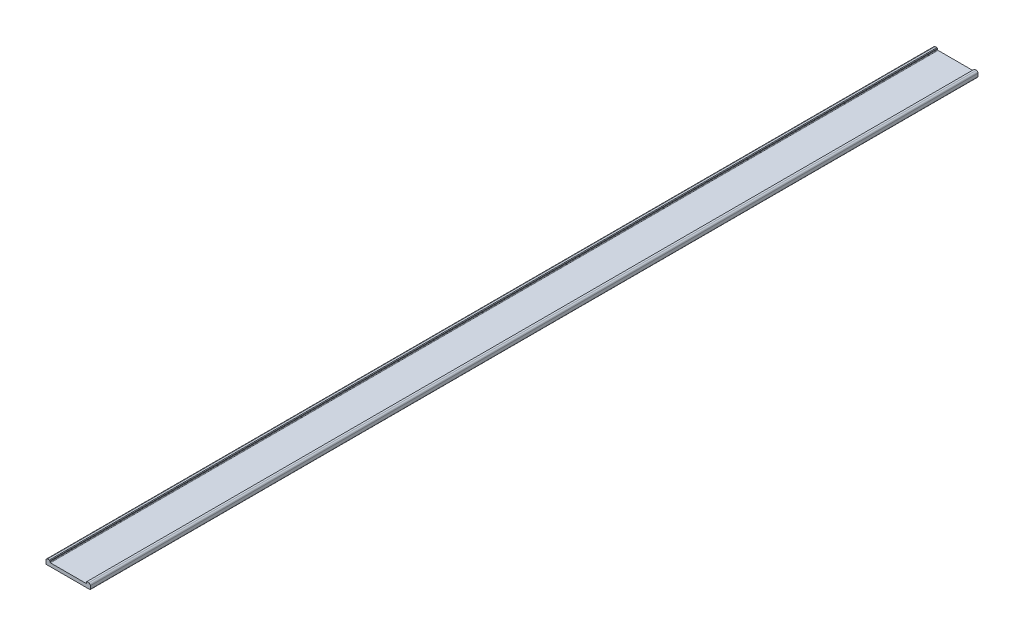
ISO-10303-21;
HEADER;
FILE_DESCRIPTION(('STEP AP214'),'2;1');
FILE_NAME('part.step','',(''),(''),'','','');
FILE_SCHEMA(('AUTOMOTIVE_DESIGN { 1 0 10303 214 1 1 1 1 }'));
ENDSEC;
DATA;
#1=APPLICATION_CONTEXT('core data for automotive mechanical design processes');
#2=APPLICATION_PROTOCOL_DEFINITION('international standard','automotive_design',2000,#1);
#3=PRODUCT_CONTEXT('',#1,'mechanical');
#4=PRODUCT('Part','Part','',(#3));
#5=PRODUCT_RELATED_PRODUCT_CATEGORY('part','',(#4));
#6=PRODUCT_DEFINITION_FORMATION('','',#4);
#7=PRODUCT_DEFINITION_CONTEXT('part definition',#1,'design');
#8=PRODUCT_DEFINITION('design','',#6,#7);
#9=PRODUCT_DEFINITION_SHAPE('','',#8);
#10=(LENGTH_UNIT() NAMED_UNIT(*) SI_UNIT(.MILLI.,.METRE.));
#11=(NAMED_UNIT(*) PLANE_ANGLE_UNIT() SI_UNIT($,.RADIAN.));
#12=(NAMED_UNIT(*) SI_UNIT($,.STERADIAN.) SOLID_ANGLE_UNIT());
#13=UNCERTAINTY_MEASURE_WITH_UNIT(LENGTH_MEASURE(1.E-05),#10,'distance_accuracy_value','');
#14=(GEOMETRIC_REPRESENTATION_CONTEXT(3) GLOBAL_UNCERTAINTY_ASSIGNED_CONTEXT((#13)) GLOBAL_UNIT_ASSIGNED_CONTEXT((#10,
#11,#12)) REPRESENTATION_CONTEXT('',''));
#15=CARTESIAN_POINT('',(0.,0.,0.));
#16=DIRECTION('',(0.,0.,1.));
#17=DIRECTION('',(1.,0.,0.));
#18=AXIS2_PLACEMENT_3D('',#15,#16,#17);
#19=CARTESIAN_POINT('',(39.5,0.5,-800.));
#20=DIRECTION('',(0.,0.,1.));
#21=DIRECTION('',(1.,0.,0.));
#22=AXIS2_PLACEMENT_3D('',#19,#20,#21);
#23=CYLINDRICAL_SURFACE('',#22,0.5);
#24=CARTESIAN_POINT('',(39.5,0.5,0.));
#25=DIRECTION('',(0.,0.,1.));
#26=DIRECTION('',(1.,0.,0.));
#27=AXIS2_PLACEMENT_3D('',#24,#25,#26);
#28=CIRCLE('',#27,0.5);
#29=CARTESIAN_POINT('',(39.5,0.,0.));
#30=VERTEX_POINT('',#29);
#31=CARTESIAN_POINT('',(40.,0.500000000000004,0.));
#32=VERTEX_POINT('',#31);
#33=EDGE_CURVE('E186',#30,#32,#28,.T.);
#34=ORIENTED_EDGE('',*,*,#33,.F.);
#35=DIRECTION('',(0.,0.,1.));
#36=VECTOR('',#35,1.);
#37=CARTESIAN_POINT('',(39.5,0.,-800.));
#38=LINE('',#37,#36);
#39=CARTESIAN_POINT('',(39.5,0.,-800.));
#40=VERTEX_POINT('',#39);
#41=EDGE_CURVE('E11',#40,#30,#38,.T.);
#42=ORIENTED_EDGE('',*,*,#41,.F.);
#43=CARTESIAN_POINT('',(39.5,0.5,-800.));
#44=DIRECTION('',(0.,0.,1.));
#45=DIRECTION('',(1.,0.,0.));
#46=AXIS2_PLACEMENT_3D('',#43,#44,#45);
#47=CIRCLE('',#46,0.5);
#48=CARTESIAN_POINT('',(40.,0.500000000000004,-800.));
#49=VERTEX_POINT('',#48);
#50=EDGE_CURVE('E230',#40,#49,#47,.T.);
#51=ORIENTED_EDGE('',*,*,#50,.T.);
#52=DIRECTION('',(0.,0.,1.));
#53=VECTOR('',#52,1.);
#54=CARTESIAN_POINT('',(40.,0.500000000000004,-800.));
#55=LINE('',#54,#53);
#56=EDGE_CURVE('E44',#49,#32,#55,.T.);
#57=ORIENTED_EDGE('',*,*,#56,.T.);
#58=EDGE_LOOP('',(#34,#42,#51,#57));
#59=FACE_BOUND('',#58,.T.);
#60=ADVANCED_FACE('F41',(#59),#23,.T.);
#61=CARTESIAN_POINT('',(0.500000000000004,0.,-800.));
#62=DIRECTION('',(0.,-1.,0.));
#63=DIRECTION('',(0.,0.,-1.));
#64=AXIS2_PLACEMENT_3D('',#61,#62,#63);
#65=PLANE('',#64);
#66=DIRECTION('',(1.,0.,0.));
#67=VECTOR('',#66,1.);
#68=CARTESIAN_POINT('',(0.500000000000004,0.,0.));
#69=LINE('',#68,#67);
#70=CARTESIAN_POINT('',(0.500000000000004,0.,0.));
#71=VERTEX_POINT('',#70);
#72=EDGE_CURVE('E228',#71,#30,#69,.T.);
#73=ORIENTED_EDGE('',*,*,#72,.F.);
#74=DIRECTION('',(0.,0.,1.));
#75=VECTOR('',#74,1.);
#76=CARTESIAN_POINT('',(0.500000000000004,0.,-800.));
#77=LINE('',#76,#75);
#78=CARTESIAN_POINT('',(0.500000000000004,0.,-800.));
#79=VERTEX_POINT('',#78);
#80=EDGE_CURVE('E50',#79,#71,#77,.T.);
#81=ORIENTED_EDGE('',*,*,#80,.F.);
#82=DIRECTION('',(1.,0.,0.));
#83=VECTOR('',#82,1.);
#84=CARTESIAN_POINT('',(0.500000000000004,0.,-800.));
#85=LINE('',#84,#83);
#86=EDGE_CURVE('E176',#79,#40,#85,.T.);
#87=ORIENTED_EDGE('',*,*,#86,.T.);
#88=ORIENTED_EDGE('',*,*,#41,.T.);
#89=EDGE_LOOP('',(#73,#81,#87,#88));
#90=FACE_BOUND('',#89,.T.);
#91=ADVANCED_FACE('F258',(#90),#65,.T.);
#92=CARTESIAN_POINT('',(0.5,0.5,-800.));
#93=DIRECTION('',(0.,0.,1.));
#94=DIRECTION('',(1.,0.,0.));
#95=AXIS2_PLACEMENT_3D('',#92,#93,#94);
#96=CYLINDRICAL_SURFACE('',#95,0.5);
#97=CARTESIAN_POINT('',(0.5,0.5,0.));
#98=DIRECTION('',(0.,0.,1.));
#99=DIRECTION('',(1.,0.,0.));
#100=AXIS2_PLACEMENT_3D('',#97,#98,#99);
#101=CIRCLE('',#100,0.5);
#102=CARTESIAN_POINT('',(0.,0.500000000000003,0.));
#103=VERTEX_POINT('',#102);
#104=EDGE_CURVE('E163',#103,#71,#101,.T.);
#105=ORIENTED_EDGE('',*,*,#104,.F.);
#106=DIRECTION('',(0.,0.,1.));
#107=VECTOR('',#106,1.);
#108=CARTESIAN_POINT('',(0.,0.500000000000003,-800.));
#109=LINE('',#108,#107);
#110=CARTESIAN_POINT('',(0.,0.500000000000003,-800.));
#111=VERTEX_POINT('',#110);
#112=EDGE_CURVE('E158',#111,#103,#109,.T.);
#113=ORIENTED_EDGE('',*,*,#112,.F.);
#114=CARTESIAN_POINT('',(0.5,0.5,-800.));
#115=DIRECTION('',(0.,0.,1.));
#116=DIRECTION('',(1.,0.,0.));
#117=AXIS2_PLACEMENT_3D('',#114,#115,#116);
#118=CIRCLE('',#117,0.5);
#119=EDGE_CURVE('E161',#111,#79,#118,.T.);
#120=ORIENTED_EDGE('',*,*,#119,.T.);
#121=ORIENTED_EDGE('',*,*,#80,.T.);
#122=EDGE_LOOP('',(#105,#113,#120,#121));
#123=FACE_BOUND('',#122,.T.);
#124=ADVANCED_FACE('F160',(#123),#96,.T.);
#125=CARTESIAN_POINT('',(0.,0.500000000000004,-800.));
#126=DIRECTION('',(-1.,0.,0.));
#127=DIRECTION('',(0.,0.,1.));
#128=AXIS2_PLACEMENT_3D('',#125,#126,#127);
#129=PLANE('',#128);
#130=DIRECTION('',(0.,-1.,0.));
#131=VECTOR('',#130,1.);
#132=CARTESIAN_POINT('',(0.,0.500000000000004,0.));
#133=LINE('',#132,#131);
#134=CARTESIAN_POINT('',(0.,3.3,0.));
#135=VERTEX_POINT('',#134);
#136=EDGE_CURVE('E225',#135,#103,#133,.T.);
#137=ORIENTED_EDGE('',*,*,#136,.F.);
#138=DIRECTION('',(0.,0.,1.));
#139=VECTOR('',#138,1.);
#140=CARTESIAN_POINT('',(0.,3.3,-800.));
#141=LINE('',#140,#139);
#142=CARTESIAN_POINT('',(0.,3.3,-800.));
#143=VERTEX_POINT('',#142);
#144=EDGE_CURVE('E168',#143,#135,#141,.T.);
#145=ORIENTED_EDGE('',*,*,#144,.F.);
#146=DIRECTION('',(0.,-1.,0.));
#147=VECTOR('',#146,1.);
#148=CARTESIAN_POINT('',(0.,0.500000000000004,-800.));
#149=LINE('',#148,#147);
#150=EDGE_CURVE('E174',#143,#111,#149,.T.);
#151=ORIENTED_EDGE('',*,*,#150,.T.);
#152=ORIENTED_EDGE('',*,*,#112,.T.);
#153=EDGE_LOOP('',(#137,#145,#151,#152));
#154=FACE_BOUND('',#153,.T.);
#155=ADVANCED_FACE('F178',(#154),#129,.T.);
#156=CARTESIAN_POINT('',(1.5,3.3,-800.));
#157=DIRECTION('',(0.,0.,1.));
#158=DIRECTION('',(1.,0.,0.));
#159=AXIS2_PLACEMENT_3D('',#156,#157,#158);
#160=CYLINDRICAL_SURFACE('',#159,1.5);
#161=CARTESIAN_POINT('',(1.5,3.3,0.));
#162=DIRECTION('',(0.,0.,1.));
#163=DIRECTION('',(-1.,0.,0.));
#164=AXIS2_PLACEMENT_3D('',#161,#162,#163);
#165=CIRCLE('',#164,1.5);
#166=CARTESIAN_POINT('',(1.5,4.8,0.));
#167=VERTEX_POINT('',#166);
#168=EDGE_CURVE('E222',#167,#135,#165,.T.);
#169=ORIENTED_EDGE('',*,*,#168,.F.);
#170=DIRECTION('',(0.,0.,1.));
#171=VECTOR('',#170,1.);
#172=CARTESIAN_POINT('',(1.5,4.8,-800.));
#173=LINE('',#172,#171);
#174=CARTESIAN_POINT('',(1.5,4.8,-800.));
#175=VERTEX_POINT('',#174);
#176=EDGE_CURVE('E234',#175,#167,#173,.T.);
#177=ORIENTED_EDGE('',*,*,#176,.F.);
#178=CARTESIAN_POINT('',(1.5,3.3,-800.));
#179=DIRECTION('',(0.,0.,1.));
#180=DIRECTION('',(-1.,0.,0.));
#181=AXIS2_PLACEMENT_3D('',#178,#179,#180);
#182=CIRCLE('',#181,1.5);
#183=EDGE_CURVE('E179',#175,#143,#182,.T.);
#184=ORIENTED_EDGE('',*,*,#183,.T.);
#185=ORIENTED_EDGE('',*,*,#144,.T.);
#186=EDGE_LOOP('',(#169,#177,#184,#185));
#187=FACE_BOUND('',#186,.T.);
#188=ADVANCED_FACE('F271',(#187),#160,.T.);
#189=CARTESIAN_POINT('',(1.5,4.8,-800.));
#190=DIRECTION('',(0.,1.,0.));
#191=DIRECTION('',(-1.,0.,0.));
#192=AXIS2_PLACEMENT_3D('',#189,#190,#191);
#193=PLANE('',#192);
#194=DIRECTION('',(-1.,0.,0.));
#195=VECTOR('',#194,1.);
#196=CARTESIAN_POINT('',(1.5,4.8,0.));
#197=LINE('',#196,#195);
#198=CARTESIAN_POINT('',(3.,4.8,0.));
#199=VERTEX_POINT('',#198);
#200=EDGE_CURVE('E219',#199,#167,#197,.T.);
#201=ORIENTED_EDGE('',*,*,#200,.F.);
#202=DIRECTION('',(0.,0.,1.));
#203=VECTOR('',#202,1.);
#204=CARTESIAN_POINT('',(3.,4.8,-800.));
#205=LINE('',#204,#203);
#206=CARTESIAN_POINT('',(3.,4.8,-800.));
#207=VERTEX_POINT('',#206);
#208=EDGE_CURVE('E236',#207,#199,#205,.T.);
#209=ORIENTED_EDGE('',*,*,#208,.F.);
#210=DIRECTION('',(-1.,0.,0.));
#211=VECTOR('',#210,1.);
#212=CARTESIAN_POINT('',(1.5,4.8,-800.));
#213=LINE('',#212,#211);
#214=EDGE_CURVE('E181',#207,#175,#213,.T.);
#215=ORIENTED_EDGE('',*,*,#214,.T.);
#216=ORIENTED_EDGE('',*,*,#176,.T.);
#217=EDGE_LOOP('',(#201,#209,#215,#216));
#218=FACE_BOUND('',#217,.T.);
#219=ADVANCED_FACE('F274',(#218),#193,.T.);
#220=CARTESIAN_POINT('',(3.,4.8,-800.));
#221=DIRECTION('',(0.707106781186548,0.707106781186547,0.));
#222=DIRECTION('',(-0.707106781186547,0.707106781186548,0.));
#223=AXIS2_PLACEMENT_3D('',#220,#221,#222);
#224=PLANE('',#223);
#225=DIRECTION('',(-0.707106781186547,0.707106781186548,0.));
#226=VECTOR('',#225,1.);
#227=CARTESIAN_POINT('',(3.,4.8,0.));
#228=LINE('',#227,#226);
#229=CARTESIAN_POINT('',(3.5,4.3,0.));
#230=VERTEX_POINT('',#229);
#231=EDGE_CURVE('E216',#230,#199,#228,.T.);
#232=ORIENTED_EDGE('',*,*,#231,.F.);
#233=DIRECTION('',(0.,0.,1.));
#234=VECTOR('',#233,1.);
#235=CARTESIAN_POINT('',(3.5,4.3,-800.));
#236=LINE('',#235,#234);
#237=CARTESIAN_POINT('',(3.5,4.3,-800.));
#238=VERTEX_POINT('',#237);
#239=EDGE_CURVE('E238',#238,#230,#236,.T.);
#240=ORIENTED_EDGE('',*,*,#239,.F.);
#241=DIRECTION('',(-0.707106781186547,0.707106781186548,0.));
#242=VECTOR('',#241,1.);
#243=CARTESIAN_POINT('',(3.,4.8,-800.));
#244=LINE('',#243,#242);
#245=EDGE_CURVE('E455',#238,#207,#244,.T.);
#246=ORIENTED_EDGE('',*,*,#245,.T.);
#247=ORIENTED_EDGE('',*,*,#208,.T.);
#248=EDGE_LOOP('',(#232,#240,#246,#247));
#249=FACE_BOUND('',#248,.T.);
#250=ADVANCED_FACE('F278',(#249),#224,.T.);
#251=CARTESIAN_POINT('',(3.5,4.3,-800.));
#252=DIRECTION('',(1.,0.,0.));
#253=DIRECTION('',(0.,1.,0.));
#254=AXIS2_PLACEMENT_3D('',#251,#252,#253);
#255=PLANE('',#254);
#256=DIRECTION('',(0.,1.,0.));
#257=VECTOR('',#256,1.);
#258=CARTESIAN_POINT('',(3.5,4.3,0.));
#259=LINE('',#258,#257);
#260=CARTESIAN_POINT('',(3.5,3.6,0.));
#261=VERTEX_POINT('',#260);
#262=EDGE_CURVE('E213',#261,#230,#259,.T.);
#263=ORIENTED_EDGE('',*,*,#262,.F.);
#264=DIRECTION('',(0.,0.,1.));
#265=VECTOR('',#264,1.);
#266=CARTESIAN_POINT('',(3.5,3.6,-800.));
#267=LINE('',#266,#265);
#268=CARTESIAN_POINT('',(3.5,3.6,-800.));
#269=VERTEX_POINT('',#268);
#270=EDGE_CURVE('E240',#269,#261,#267,.T.);
#271=ORIENTED_EDGE('',*,*,#270,.F.);
#272=DIRECTION('',(0.,1.,0.));
#273=VECTOR('',#272,1.);
#274=CARTESIAN_POINT('',(3.5,4.3,-800.));
#275=LINE('',#274,#273);
#276=EDGE_CURVE('E451',#269,#238,#275,.T.);
#277=ORIENTED_EDGE('',*,*,#276,.T.);
#278=ORIENTED_EDGE('',*,*,#239,.T.);
#279=EDGE_LOOP('',(#263,#271,#277,#278));
#280=FACE_BOUND('',#279,.T.);
#281=ADVANCED_FACE('F282',(#280),#255,.T.);
#282=CARTESIAN_POINT('',(4.,3.6,-800.));
#283=DIRECTION('',(0.,0.,1.));
#284=DIRECTION('',(1.,0.,0.));
#285=AXIS2_PLACEMENT_3D('',#282,#283,#284);
#286=CYLINDRICAL_SURFACE('',#285,0.5);
#287=CARTESIAN_POINT('',(4.,3.6,0.));
#288=DIRECTION('',(0.,0.,-1.));
#289=DIRECTION('',(1.,0.,0.));
#290=AXIS2_PLACEMENT_3D('',#287,#288,#289);
#291=CIRCLE('',#290,0.5);
#292=CARTESIAN_POINT('',(4.,3.1,0.));
#293=VERTEX_POINT('',#292);
#294=EDGE_CURVE('E210',#293,#261,#291,.T.);
#295=ORIENTED_EDGE('',*,*,#294,.F.);
#296=DIRECTION('',(0.,0.,1.));
#297=VECTOR('',#296,1.);
#298=CARTESIAN_POINT('',(4.,3.1,-800.));
#299=LINE('',#298,#297);
#300=CARTESIAN_POINT('',(4.,3.1,-800.));
#301=VERTEX_POINT('',#300);
#302=EDGE_CURVE('E242',#301,#293,#299,.T.);
#303=ORIENTED_EDGE('',*,*,#302,.F.);
#304=CARTESIAN_POINT('',(4.,3.6,-800.));
#305=DIRECTION('',(0.,0.,-1.));
#306=DIRECTION('',(1.,0.,0.));
#307=AXIS2_PLACEMENT_3D('',#304,#305,#306);
#308=CIRCLE('',#307,0.5);
#309=EDGE_CURVE('E462',#301,#269,#308,.T.);
#310=ORIENTED_EDGE('',*,*,#309,.T.);
#311=ORIENTED_EDGE('',*,*,#270,.T.);
#312=EDGE_LOOP('',(#295,#303,#310,#311));
#313=FACE_BOUND('',#312,.T.);
#314=ADVANCED_FACE('F286',(#313),#286,.F.);
#315=CARTESIAN_POINT('',(4.,3.1,-800.));
#316=DIRECTION('',(0.,1.,0.));
#317=DIRECTION('',(0.,0.,1.));
#318=AXIS2_PLACEMENT_3D('',#315,#316,#317);
#319=PLANE('',#318);
#320=DIRECTION('',(-1.,0.,0.));
#321=VECTOR('',#320,1.);
#322=CARTESIAN_POINT('',(4.,3.1,0.));
#323=LINE('',#322,#321);
#324=CARTESIAN_POINT('',(36.,3.1,0.));
#325=VERTEX_POINT('',#324);
#326=EDGE_CURVE('E207',#325,#293,#323,.T.);
#327=ORIENTED_EDGE('',*,*,#326,.F.);
#328=DIRECTION('',(0.,0.,1.));
#329=VECTOR('',#328,1.);
#330=CARTESIAN_POINT('',(36.,3.1,-800.));
#331=LINE('',#330,#329);
#332=CARTESIAN_POINT('',(36.,3.1,-800.));
#333=VERTEX_POINT('',#332);
#334=EDGE_CURVE('E244',#333,#325,#331,.T.);
#335=ORIENTED_EDGE('',*,*,#334,.F.);
#336=DIRECTION('',(-1.,0.,0.));
#337=VECTOR('',#336,1.);
#338=CARTESIAN_POINT('',(4.,3.1,-800.));
#339=LINE('',#338,#337);
#340=EDGE_CURVE('E444',#333,#301,#339,.T.);
#341=ORIENTED_EDGE('',*,*,#340,.T.);
#342=ORIENTED_EDGE('',*,*,#302,.T.);
#343=EDGE_LOOP('',(#327,#335,#341,#342));
#344=FACE_BOUND('',#343,.T.);
#345=ADVANCED_FACE('F290',(#344),#319,.T.);
#346=CARTESIAN_POINT('',(36.,3.6,-800.));
#347=DIRECTION('',(0.,0.,1.));
#348=DIRECTION('',(1.,0.,0.));
#349=AXIS2_PLACEMENT_3D('',#346,#347,#348);
#350=CYLINDRICAL_SURFACE('',#349,0.5);
#351=CARTESIAN_POINT('',(36.,3.6,0.));
#352=DIRECTION('',(0.,0.,-1.));
#353=DIRECTION('',(-1.,0.,0.));
#354=AXIS2_PLACEMENT_3D('',#351,#352,#353);
#355=CIRCLE('',#354,0.5);
#356=CARTESIAN_POINT('',(36.5,3.6,0.));
#357=VERTEX_POINT('',#356);
#358=EDGE_CURVE('E204',#357,#325,#355,.T.);
#359=ORIENTED_EDGE('',*,*,#358,.F.);
#360=DIRECTION('',(0.,0.,1.));
#361=VECTOR('',#360,1.);
#362=CARTESIAN_POINT('',(36.5,3.6,-800.));
#363=LINE('',#362,#361);
#364=CARTESIAN_POINT('',(36.5,3.6,-800.));
#365=VERTEX_POINT('',#364);
#366=EDGE_CURVE('E246',#365,#357,#363,.T.);
#367=ORIENTED_EDGE('',*,*,#366,.F.);
#368=CARTESIAN_POINT('',(36.,3.6,-800.));
#369=DIRECTION('',(0.,0.,-1.));
#370=DIRECTION('',(-1.,0.,0.));
#371=AXIS2_PLACEMENT_3D('',#368,#369,#370);
#372=CIRCLE('',#371,0.5);
#373=EDGE_CURVE('E440',#365,#333,#372,.T.);
#374=ORIENTED_EDGE('',*,*,#373,.T.);
#375=ORIENTED_EDGE('',*,*,#334,.T.);
#376=EDGE_LOOP('',(#359,#367,#374,#375));
#377=FACE_BOUND('',#376,.T.);
#378=ADVANCED_FACE('F294',(#377),#350,.F.);
#379=CARTESIAN_POINT('',(36.5,4.55,-800.));
#380=DIRECTION('',(-1.,0.,0.));
#381=DIRECTION('',(0.,0.,1.));
#382=AXIS2_PLACEMENT_3D('',#379,#380,#381);
#383=PLANE('',#382);
#384=DIRECTION('',(0.,-1.,0.));
#385=VECTOR('',#384,1.);
#386=CARTESIAN_POINT('',(36.5,4.55,0.));
#387=LINE('',#386,#385);
#388=CARTESIAN_POINT('',(36.5,4.55,0.));
#389=VERTEX_POINT('',#388);
#390=EDGE_CURVE('E201',#389,#357,#387,.T.);
#391=ORIENTED_EDGE('',*,*,#390,.F.);
#392=DIRECTION('',(0.,0.,1.));
#393=VECTOR('',#392,1.);
#394=CARTESIAN_POINT('',(36.5,4.55,-800.));
#395=LINE('',#394,#393);
#396=CARTESIAN_POINT('',(36.5,4.55,-800.));
#397=VERTEX_POINT('',#396);
#398=EDGE_CURVE('E248',#397,#389,#395,.T.);
#399=ORIENTED_EDGE('',*,*,#398,.F.);
#400=DIRECTION('',(0.,-1.,0.));
#401=VECTOR('',#400,1.);
#402=CARTESIAN_POINT('',(36.5,4.55,-800.));
#403=LINE('',#402,#401);
#404=EDGE_CURVE('E466',#397,#365,#403,.T.);
#405=ORIENTED_EDGE('',*,*,#404,.T.);
#406=ORIENTED_EDGE('',*,*,#366,.T.);
#407=EDGE_LOOP('',(#391,#399,#405,#406));
#408=FACE_BOUND('',#407,.T.);
#409=ADVANCED_FACE('F298',(#408),#383,.T.);
#410=CARTESIAN_POINT('',(36.75,4.8,-800.));
#411=DIRECTION('',(-0.707106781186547,0.707106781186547,0.));
#412=DIRECTION('',(-0.707106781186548,-0.707106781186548,0.));
#413=AXIS2_PLACEMENT_3D('',#410,#411,#412);
#414=PLANE('',#413);
#415=DIRECTION('',(-0.707106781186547,-0.707106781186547,0.));
#416=VECTOR('',#415,1.);
#417=CARTESIAN_POINT('',(36.75,4.8,0.));
#418=LINE('',#417,#416);
#419=CARTESIAN_POINT('',(36.75,4.8,0.));
#420=VERTEX_POINT('',#419);
#421=EDGE_CURVE('E198',#420,#389,#418,.T.);
#422=ORIENTED_EDGE('',*,*,#421,.F.);
#423=DIRECTION('',(0.,0.,1.));
#424=VECTOR('',#423,1.);
#425=CARTESIAN_POINT('',(36.75,4.8,-800.));
#426=LINE('',#425,#424);
#427=CARTESIAN_POINT('',(36.75,4.8,-800.));
#428=VERTEX_POINT('',#427);
#429=EDGE_CURVE('E250',#428,#420,#426,.T.);
#430=ORIENTED_EDGE('',*,*,#429,.F.);
#431=DIRECTION('',(-0.707106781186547,-0.707106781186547,0.));
#432=VECTOR('',#431,1.);
#433=CARTESIAN_POINT('',(36.75,4.8,-800.));
#434=LINE('',#433,#432);
#435=EDGE_CURVE('E433',#428,#397,#434,.T.);
#436=ORIENTED_EDGE('',*,*,#435,.T.);
#437=ORIENTED_EDGE('',*,*,#398,.T.);
#438=EDGE_LOOP('',(#422,#430,#436,#437));
#439=FACE_BOUND('',#438,.T.);
#440=ADVANCED_FACE('F302',(#439),#414,.T.);
#441=CARTESIAN_POINT('',(36.75,4.8,-800.));
#442=DIRECTION('',(0.,1.,0.));
#443=DIRECTION('',(0.,0.,1.));
#444=AXIS2_PLACEMENT_3D('',#441,#442,#443);
#445=PLANE('',#444);
#446=DIRECTION('',(-1.,0.,0.));
#447=VECTOR('',#446,1.);
#448=CARTESIAN_POINT('',(36.75,4.8,0.));
#449=LINE('',#448,#447);
#450=CARTESIAN_POINT('',(38.5,4.8,0.));
#451=VERTEX_POINT('',#450);
#452=EDGE_CURVE('E195',#451,#420,#449,.T.);
#453=ORIENTED_EDGE('',*,*,#452,.F.);
#454=DIRECTION('',(0.,0.,1.));
#455=VECTOR('',#454,1.);
#456=CARTESIAN_POINT('',(38.5,4.8,-800.));
#457=LINE('',#456,#455);
#458=CARTESIAN_POINT('',(38.5,4.8,-800.));
#459=VERTEX_POINT('',#458);
#460=EDGE_CURVE('E252',#459,#451,#457,.T.);
#461=ORIENTED_EDGE('',*,*,#460,.F.);
#462=DIRECTION('',(-1.,0.,0.));
#463=VECTOR('',#462,1.);
#464=CARTESIAN_POINT('',(36.75,4.8,-800.));
#465=LINE('',#464,#463);
#466=EDGE_CURVE('E429',#459,#428,#465,.T.);
#467=ORIENTED_EDGE('',*,*,#466,.T.);
#468=ORIENTED_EDGE('',*,*,#429,.T.);
#469=EDGE_LOOP('',(#453,#461,#467,#468));
#470=FACE_BOUND('',#469,.T.);
#471=ADVANCED_FACE('F306',(#470),#445,.T.);
#472=CARTESIAN_POINT('',(38.5,3.3,-800.));
#473=DIRECTION('',(0.,0.,1.));
#474=DIRECTION('',(1.,0.,0.));
#475=AXIS2_PLACEMENT_3D('',#472,#473,#474);
#476=CYLINDRICAL_SURFACE('',#475,1.5);
#477=CARTESIAN_POINT('',(38.5,3.3,0.));
#478=DIRECTION('',(0.,0.,1.));
#479=DIRECTION('',(-1.,0.,0.));
#480=AXIS2_PLACEMENT_3D('',#477,#478,#479);
#481=CIRCLE('',#480,1.5);
#482=CARTESIAN_POINT('',(40.,3.3,0.));
#483=VERTEX_POINT('',#482);
#484=EDGE_CURVE('E192',#483,#451,#481,.T.);
#485=ORIENTED_EDGE('',*,*,#484,.F.);
#486=DIRECTION('',(0.,0.,1.));
#487=VECTOR('',#486,1.);
#488=CARTESIAN_POINT('',(40.,3.3,-800.));
#489=LINE('',#488,#487);
#490=CARTESIAN_POINT('',(40.,3.3,-800.));
#491=VERTEX_POINT('',#490);
#492=EDGE_CURVE('E253',#491,#483,#489,.T.);
#493=ORIENTED_EDGE('',*,*,#492,.F.);
#494=CARTESIAN_POINT('',(38.5,3.3,-800.));
#495=DIRECTION('',(0.,0.,1.));
#496=DIRECTION('',(-1.,0.,0.));
#497=AXIS2_PLACEMENT_3D('',#494,#495,#496);
#498=CIRCLE('',#497,1.5);
#499=EDGE_CURVE('E470',#491,#459,#498,.T.);
#500=ORIENTED_EDGE('',*,*,#499,.T.);
#501=ORIENTED_EDGE('',*,*,#460,.T.);
#502=EDGE_LOOP('',(#485,#493,#500,#501));
#503=FACE_BOUND('',#502,.T.);
#504=ADVANCED_FACE('F310',(#503),#476,.T.);
#505=CARTESIAN_POINT('',(40.,0.500000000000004,-800.));
#506=DIRECTION('',(1.,0.,0.));
#507=DIRECTION('',(0.,0.,-1.));
#508=AXIS2_PLACEMENT_3D('',#505,#506,#507);
#509=PLANE('',#508);
#510=DIRECTION('',(0.,1.,0.));
#511=VECTOR('',#510,1.);
#512=CARTESIAN_POINT('',(40.,0.500000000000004,0.));
#513=LINE('',#512,#511);
#514=EDGE_CURVE('E189',#32,#483,#513,.T.);
#515=ORIENTED_EDGE('',*,*,#514,.F.);
#516=ORIENTED_EDGE('',*,*,#56,.F.);
#517=DIRECTION('',(0.,1.,0.));
#518=VECTOR('',#517,1.);
#519=CARTESIAN_POINT('',(40.,0.500000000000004,-800.));
#520=LINE('',#519,#518);
#521=EDGE_CURVE('E472',#49,#491,#520,.T.);
#522=ORIENTED_EDGE('',*,*,#521,.T.);
#523=ORIENTED_EDGE('',*,*,#492,.T.);
#524=EDGE_LOOP('',(#515,#516,#522,#523));
#525=FACE_BOUND('',#524,.T.);
#526=ADVANCED_FACE('F255',(#525),#509,.T.);
#527=CARTESIAN_POINT('',(39.5,0.5,-800.));
#528=DIRECTION('',(0.,0.,1.));
#529=DIRECTION('',(1.,0.,0.));
#530=AXIS2_PLACEMENT_3D('',#527,#528,#529);
#531=PLANE('',#530);
#532=ORIENTED_EDGE('',*,*,#50,.F.);
#533=ORIENTED_EDGE('',*,*,#86,.F.);
#534=ORIENTED_EDGE('',*,*,#119,.F.);
#535=ORIENTED_EDGE('',*,*,#150,.F.);
#536=ORIENTED_EDGE('',*,*,#183,.F.);
#537=ORIENTED_EDGE('',*,*,#214,.F.);
#538=ORIENTED_EDGE('',*,*,#245,.F.);
#539=ORIENTED_EDGE('',*,*,#276,.F.);
#540=ORIENTED_EDGE('',*,*,#309,.F.);
#541=ORIENTED_EDGE('',*,*,#340,.F.);
#542=ORIENTED_EDGE('',*,*,#373,.F.);
#543=ORIENTED_EDGE('',*,*,#404,.F.);
#544=ORIENTED_EDGE('',*,*,#435,.F.);
#545=ORIENTED_EDGE('',*,*,#466,.F.);
#546=ORIENTED_EDGE('',*,*,#499,.F.);
#547=ORIENTED_EDGE('',*,*,#521,.F.);
#548=EDGE_LOOP('',(#532,#533,#534,#535,#536,#537,#538,#539,#540,#541,#542,#543,#544,#545,#546,#547));
#549=FACE_BOUND('',#548,.T.);
#550=ADVANCED_FACE('F172',(#549),#531,.F.);
#551=CARTESIAN_POINT('',(39.5,0.5,0.));
#552=DIRECTION('',(0.,0.,1.));
#553=DIRECTION('',(1.,0.,0.));
#554=AXIS2_PLACEMENT_3D('',#551,#552,#553);
#555=PLANE('',#554);
#556=ORIENTED_EDGE('',*,*,#33,.T.);
#557=ORIENTED_EDGE('',*,*,#514,.T.);
#558=ORIENTED_EDGE('',*,*,#484,.T.);
#559=ORIENTED_EDGE('',*,*,#452,.T.);
#560=ORIENTED_EDGE('',*,*,#421,.T.);
#561=ORIENTED_EDGE('',*,*,#390,.T.);
#562=ORIENTED_EDGE('',*,*,#358,.T.);
#563=ORIENTED_EDGE('',*,*,#326,.T.);
#564=ORIENTED_EDGE('',*,*,#294,.T.);
#565=ORIENTED_EDGE('',*,*,#262,.T.);
#566=ORIENTED_EDGE('',*,*,#231,.T.);
#567=ORIENTED_EDGE('',*,*,#200,.T.);
#568=ORIENTED_EDGE('',*,*,#168,.T.);
#569=ORIENTED_EDGE('',*,*,#136,.T.);
#570=ORIENTED_EDGE('',*,*,#104,.T.);
#571=ORIENTED_EDGE('',*,*,#72,.T.);
#572=EDGE_LOOP('',(#556,#557,#558,#559,#560,#561,#562,#563,#564,#565,#566,#567,#568,#569,#570,#571));
#573=FACE_BOUND('',#572,.T.);
#574=ADVANCED_FACE('F257',(#573),#555,.T.);
#575=CLOSED_SHELL('',(#60,#91,#124,#155,#188,#219,#250,#281,#314,#345,#378,#409,#440,#471,#504,
#526,#550,#574));
#576=MANIFOLD_SOLID_BREP('B2',#575);
#577=ADVANCED_BREP_SHAPE_REPRESENTATION('',(#18,#576),#14);
#578=SHAPE_DEFINITION_REPRESENTATION(#9,#577);
ENDSEC;
END-ISO-10303-21;
